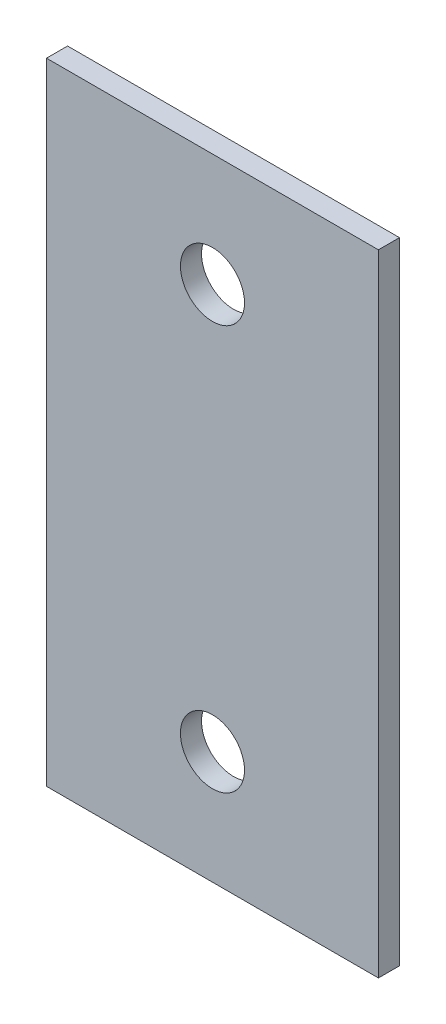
from build123d import *

# Parameters (mm, degrees)
SKETCH1_W               = 95
SKETCH1_H               = 50
BOSS_EXTRUDE1_DEPTH     = 1.5875
CUT_EXTRUDE1_DEPTH      = 54.700746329
CUT_EXTRUDE1_DEPTH_BACK = 54.700746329
SKETCH2_R               = 4.826


with BuildPart() as part:
    # Sketch1 → Boss-Extrude1 (new, symmetric)
    with BuildSketch(Plane(origin=(0, 0, 0), x_dir=(0, 1, 0), z_dir=(0, 0, 1))):
        Rectangle(SKETCH1_W, SKETCH1_H)
    extrude(amount=BOSS_EXTRUDE1_DEPTH, both=True)

    # Sketch2 → Cut-Extrude1 (cut, two sides: drawn at the far end of the back side and taken through both)
    with BuildSketch(Plane(origin=(0, 0, 0), x_dir=(0, 1, 0), z_dir=(0, 0, 1)).offset(-CUT_EXTRUDE1_DEPTH_BACK)):
        with Locations(Location((-30.48, 0, 0), (0, 0, 270))):
            Circle(SKETCH2_R)
        with Locations(Location((30.48, 0, 0), (0, 0, 270))):
            Circle(SKETCH2_R)
    extrude(amount=CUT_EXTRUDE1_DEPTH + CUT_EXTRUDE1_DEPTH_BACK, mode=Mode.SUBTRACT)


solid = part.part
